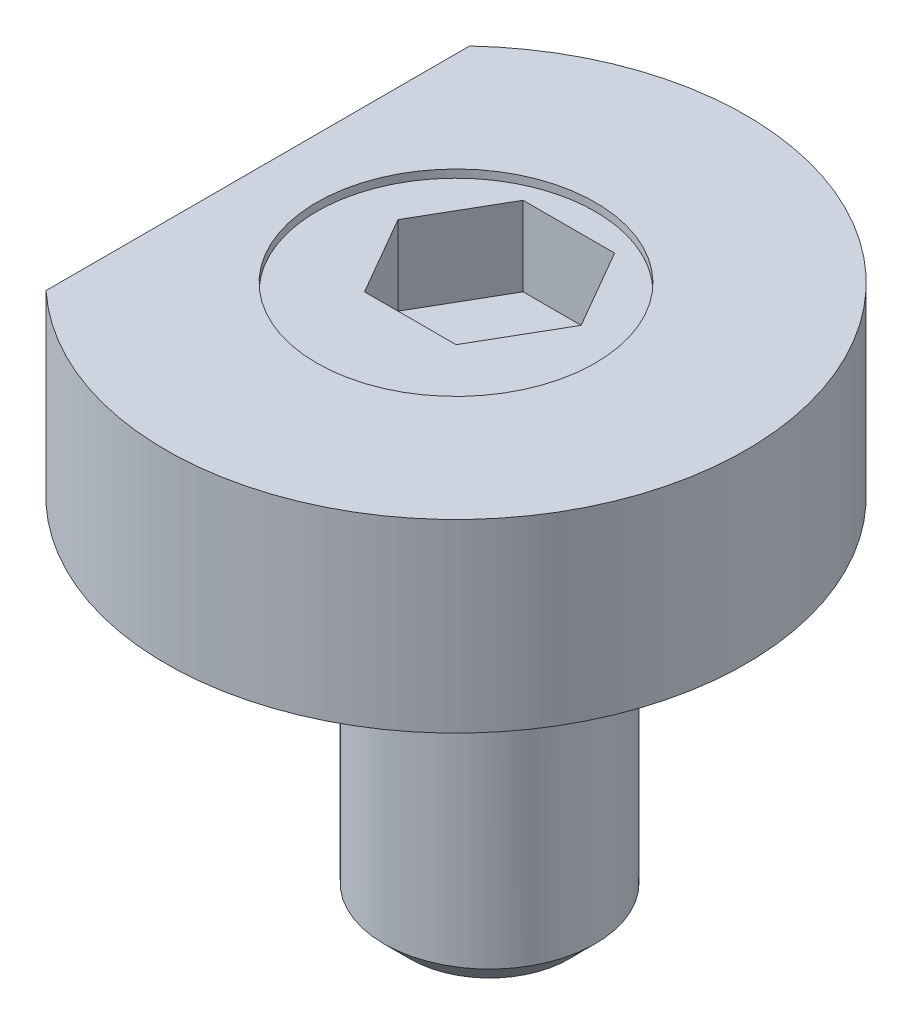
ISO-10303-21;
HEADER;
FILE_DESCRIPTION(('STEP AP214'),'2;1');
FILE_NAME('part.step','',(''),(''),'','','');
FILE_SCHEMA(('AUTOMOTIVE_DESIGN { 1 0 10303 214 1 1 1 1 }'));
ENDSEC;
DATA;
#1=APPLICATION_CONTEXT('core data for automotive mechanical design processes');
#2=APPLICATION_PROTOCOL_DEFINITION('international standard','automotive_design',2000,#1);
#3=PRODUCT_CONTEXT('',#1,'mechanical');
#4=PRODUCT('Part','Part','',(#3));
#5=PRODUCT_RELATED_PRODUCT_CATEGORY('part','',(#4));
#6=PRODUCT_DEFINITION_FORMATION('','',#4);
#7=PRODUCT_DEFINITION_CONTEXT('part definition',#1,'design');
#8=PRODUCT_DEFINITION('design','',#6,#7);
#9=PRODUCT_DEFINITION_SHAPE('','',#8);
#10=(LENGTH_UNIT() NAMED_UNIT(*) SI_UNIT(.MILLI.,.METRE.));
#11=(NAMED_UNIT(*) PLANE_ANGLE_UNIT() SI_UNIT($,.RADIAN.));
#12=(NAMED_UNIT(*) SI_UNIT($,.STERADIAN.) SOLID_ANGLE_UNIT());
#13=UNCERTAINTY_MEASURE_WITH_UNIT(LENGTH_MEASURE(1.E-05),#10,'distance_accuracy_value','');
#14=(GEOMETRIC_REPRESENTATION_CONTEXT(3) GLOBAL_UNCERTAINTY_ASSIGNED_CONTEXT((#13)) GLOBAL_UNIT_ASSIGNED_CONTEXT((#10,
#11,#12)) REPRESENTATION_CONTEXT('',''));
#15=CARTESIAN_POINT('',(0.,0.,0.));
#16=DIRECTION('',(0.,0.,1.));
#17=DIRECTION('',(1.,0.,0.));
#18=AXIS2_PLACEMENT_3D('',#15,#16,#17);
#19=CARTESIAN_POINT('',(0.,-28.6,-2.54));
#20=DIRECTION('',(0.,1.,0.));
#21=DIRECTION('',(0.,0.,1.));
#22=AXIS2_PLACEMENT_3D('',#19,#20,#21);
#23=CYLINDRICAL_SURFACE('',#22,8.);
#24=CARTESIAN_POINT('',(0.,-26.6,-2.54));
#25=DIRECTION('',(0.,1.,0.));
#26=DIRECTION('',(0.,0.,1.));
#27=AXIS2_PLACEMENT_3D('',#24,#25,#26);
#28=CIRCLE('',#27,8.);
#29=CARTESIAN_POINT('',(0.,-26.6,5.46));
#30=VERTEX_POINT('',#29);
#31=EDGE_CURVE('P0_E24',#30,#30,#28,.T.);
#32=ORIENTED_EDGE('',*,*,#31,.T.);
#33=EDGE_LOOP('',(#32));
#34=FACE_BOUND('',#33,.T.);
#35=CARTESIAN_POINT('',(0.,3.4,-2.54));
#36=DIRECTION('',(0.,1.,0.));
#37=DIRECTION('',(0.,0.,1.));
#38=AXIS2_PLACEMENT_3D('',#35,#36,#37);
#39=CIRCLE('',#38,8.);
#40=CARTESIAN_POINT('',(0.,3.4,-10.54));
#41=VERTEX_POINT('',#40);
#42=EDGE_CURVE('P0_E37',#41,#41,#39,.T.);
#43=ORIENTED_EDGE('',*,*,#42,.F.);
#44=EDGE_LOOP('',(#43));
#45=FACE_BOUND('',#44,.T.);
#46=ADVANCED_FACE('P0_F16',(#34,#45),#23,.T.);
#47=CARTESIAN_POINT('',(0.,-28.6,-2.54));
#48=DIRECTION('',(0.,1.,0.));
#49=DIRECTION('',(0.,0.,1.));
#50=AXIS2_PLACEMENT_3D('',#47,#48,#49);
#51=PLANE('',#50);
#52=CARTESIAN_POINT('',(0.,-28.6,-2.54));
#53=DIRECTION('',(0.,1.,0.));
#54=DIRECTION('',(0.,0.,1.));
#55=AXIS2_PLACEMENT_3D('',#52,#53,#54);
#56=CIRCLE('',#55,5.99999999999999);
#57=CARTESIAN_POINT('',(0.,-28.6,3.45999999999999));
#58=VERTEX_POINT('',#57);
#59=EDGE_CURVE('P0_E11',#58,#58,#56,.F.);
#60=ORIENTED_EDGE('',*,*,#59,.T.);
#61=EDGE_LOOP('',(#60));
#62=FACE_BOUND('',#61,.T.);
#63=ADVANCED_FACE('P0_F137',(#62),#51,.F.);
#64=CARTESIAN_POINT('',(0.,-26.6,-2.54));
#65=DIRECTION('',(0.,1.,0.));
#66=DIRECTION('',(0.,0.,1.));
#67=AXIS2_PLACEMENT_3D('',#64,#65,#66);
#68=CONICAL_SURFACE('',#67,8.,0.78539816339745);
#69=ORIENTED_EDGE('',*,*,#59,.F.);
#70=EDGE_LOOP('',(#69));
#71=FACE_BOUND('',#70,.T.);
#72=ORIENTED_EDGE('',*,*,#31,.F.);
#73=EDGE_LOOP('',(#72));
#74=FACE_BOUND('',#73,.T.);
#75=ADVANCED_FACE('P0_F18',(#71,#74),#68,.T.);
#76=CARTESIAN_POINT('',(0.,3.4,0.));
#77=DIRECTION('',(0.,1.,0.));
#78=DIRECTION('',(0.,0.,1.));
#79=AXIS2_PLACEMENT_3D('',#76,#77,#78);
#80=PLANE('',#79);
#81=CARTESIAN_POINT('',(0.,3.4,0.));
#82=DIRECTION('',(0.,1.,0.));
#83=DIRECTION('',(0.,0.,1.));
#84=AXIS2_PLACEMENT_3D('',#81,#82,#83);
#85=CIRCLE('',#84,10.54);
#86=EDGE_CURVE('P0_E118',#41,#41,#85,.T.);
#87=ORIENTED_EDGE('',*,*,#86,.F.);
#88=ORIENTED_EDGE('',*,*,#42,.T.);
#89=EDGE_LOOP('',(#87,#88));
#90=FACE_BOUND('',#89,.T.);
#91=ADVANCED_FACE('P0_F136',(#90),#80,.F.);
#92=CARTESIAN_POINT('',(0.,13.4,0.));
#93=DIRECTION('',(0.,-1.,0.));
#94=DIRECTION('',(0.,0.,-1.));
#95=AXIS2_PLACEMENT_3D('',#92,#93,#94);
#96=CYLINDRICAL_SURFACE('',#95,10.54);
#97=CARTESIAN_POINT('',(0.,13.4,0.));
#98=DIRECTION('',(0.,1.,0.));
#99=DIRECTION('',(0.,0.,1.));
#100=AXIS2_PLACEMENT_3D('',#97,#98,#99);
#101=CIRCLE('',#100,10.54);
#102=CARTESIAN_POINT('',(0.,13.4,10.54));
#103=VERTEX_POINT('',#102);
#104=EDGE_CURVE('P0_E126',#103,#103,#101,.T.);
#105=ORIENTED_EDGE('',*,*,#104,.F.);
#106=EDGE_LOOP('',(#105));
#107=FACE_BOUND('',#106,.T.);
#108=ORIENTED_EDGE('',*,*,#86,.T.);
#109=EDGE_LOOP('',(#108));
#110=FACE_BOUND('',#109,.T.);
#111=ADVANCED_FACE('P0_F144',(#107,#110),#96,.T.);
#112=CARTESIAN_POINT('',(0.,13.4,0.));
#113=DIRECTION('',(0.,1.,0.));
#114=DIRECTION('',(0.,0.,1.));
#115=AXIS2_PLACEMENT_3D('',#112,#113,#114);
#116=PLANE('',#115);
#117=DIRECTION('',(-0.5,0.,-0.866025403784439));
#118=VECTOR('',#117,1.);
#119=CARTESIAN_POINT('',(6.92820323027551,13.4,-2.54));
#120=LINE('',#119,#118);
#121=CARTESIAN_POINT('',(6.92820323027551,13.4,-2.54));
#122=VERTEX_POINT('',#121);
#123=CARTESIAN_POINT('',(3.46410161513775,13.4,-8.54));
#124=VERTEX_POINT('',#123);
#125=EDGE_CURVE('P0_E31',#122,#124,#120,.T.);
#126=ORIENTED_EDGE('',*,*,#125,.F.);
#127=DIRECTION('',(0.5,0.,-0.866025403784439));
#128=VECTOR('',#127,1.);
#129=CARTESIAN_POINT('',(3.46410161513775,13.4,3.46));
#130=LINE('',#129,#128);
#131=CARTESIAN_POINT('',(3.46410161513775,13.4,3.46));
#132=VERTEX_POINT('',#131);
#133=EDGE_CURVE('P0_E92',#132,#122,#130,.T.);
#134=ORIENTED_EDGE('',*,*,#133,.F.);
#135=DIRECTION('',(1.,0.,0.));
#136=VECTOR('',#135,1.);
#137=CARTESIAN_POINT('',(-3.46410161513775,13.4,3.46));
#138=LINE('',#137,#136);
#139=CARTESIAN_POINT('',(-3.46410161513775,13.4,3.46));
#140=VERTEX_POINT('',#139);
#141=EDGE_CURVE('P0_E95',#140,#132,#138,.T.);
#142=ORIENTED_EDGE('',*,*,#141,.F.);
#143=DIRECTION('',(0.5,0.,0.866025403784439));
#144=VECTOR('',#143,1.);
#145=CARTESIAN_POINT('',(-6.92820323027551,13.4,-2.54));
#146=LINE('',#145,#144);
#147=CARTESIAN_POINT('',(-6.92820323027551,13.4,-2.54));
#148=VERTEX_POINT('',#147);
#149=EDGE_CURVE('P0_E111',#148,#140,#146,.T.);
#150=ORIENTED_EDGE('',*,*,#149,.F.);
#151=DIRECTION('',(-0.5,0.,0.866025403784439));
#152=VECTOR('',#151,1.);
#153=CARTESIAN_POINT('',(-3.46410161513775,13.4,-8.54));
#154=LINE('',#153,#152);
#155=CARTESIAN_POINT('',(-3.46410161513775,13.4,-8.54));
#156=VERTEX_POINT('',#155);
#157=EDGE_CURVE('P0_E108',#156,#148,#154,.T.);
#158=ORIENTED_EDGE('',*,*,#157,.F.);
#159=DIRECTION('',(-1.,0.,0.));
#160=VECTOR('',#159,1.);
#161=CARTESIAN_POINT('',(3.46410161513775,13.4,-8.54));
#162=LINE('',#161,#160);
#163=EDGE_CURVE('P0_E106',#124,#156,#162,.T.);
#164=ORIENTED_EDGE('',*,*,#163,.F.);
#165=EDGE_LOOP('',(#126,#134,#142,#150,#158,#164));
#166=FACE_BOUND('',#165,.T.);
#167=ORIENTED_EDGE('',*,*,#104,.T.);
#168=EDGE_LOOP('',(#167));
#169=FACE_BOUND('',#168,.T.);
#170=ADVANCED_FACE('P0_F155',(#166,#169),#116,.T.);
#171=CARTESIAN_POINT('',(6.92820323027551,7.4,-2.54));
#172=DIRECTION('',(0.866025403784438,0.,-0.5));
#173=DIRECTION('',(-0.5,0.,-0.866025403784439));
#174=AXIS2_PLACEMENT_3D('',#171,#172,#173);
#175=PLANE('',#174);
#176=ORIENTED_EDGE('',*,*,#125,.T.);
#177=DIRECTION('',(0.,1.,0.));
#178=VECTOR('',#177,1.);
#179=CARTESIAN_POINT('',(3.46410161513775,7.4,-8.54));
#180=LINE('',#179,#178);
#181=CARTESIAN_POINT('',(3.46410161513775,7.4,-8.54));
#182=VERTEX_POINT('',#181);
#183=EDGE_CURVE('P0_E69',#182,#124,#180,.T.);
#184=ORIENTED_EDGE('',*,*,#183,.F.);
#185=DIRECTION('',(-0.5,0.,-0.866025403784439));
#186=VECTOR('',#185,1.);
#187=CARTESIAN_POINT('',(6.92820323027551,7.4,-2.54));
#188=LINE('',#187,#186);
#189=CARTESIAN_POINT('',(6.92820323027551,7.4,-2.54));
#190=VERTEX_POINT('',#189);
#191=EDGE_CURVE('P0_E73',#190,#182,#188,.T.);
#192=ORIENTED_EDGE('',*,*,#191,.F.);
#193=DIRECTION('',(0.,1.,0.));
#194=VECTOR('',#193,1.);
#195=CARTESIAN_POINT('',(6.92820323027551,7.4,-2.54));
#196=LINE('',#195,#194);
#197=EDGE_CURVE('P0_E116',#190,#122,#196,.T.);
#198=ORIENTED_EDGE('',*,*,#197,.T.);
#199=EDGE_LOOP('',(#176,#184,#192,#198));
#200=FACE_BOUND('',#199,.T.);
#201=ADVANCED_FACE('P0_F71',(#200),#175,.F.);
#202=CARTESIAN_POINT('',(3.46410161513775,7.4,3.46));
#203=DIRECTION('',(0.866025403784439,0.,0.5));
#204=DIRECTION('',(0.5,0.,-0.866025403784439));
#205=AXIS2_PLACEMENT_3D('',#202,#203,#204);
#206=PLANE('',#205);
#207=ORIENTED_EDGE('',*,*,#133,.T.);
#208=ORIENTED_EDGE('',*,*,#197,.F.);
#209=DIRECTION('',(0.5,0.,-0.866025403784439));
#210=VECTOR('',#209,1.);
#211=CARTESIAN_POINT('',(3.46410161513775,7.4,3.46));
#212=LINE('',#211,#210);
#213=CARTESIAN_POINT('',(3.46410161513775,7.4,3.46));
#214=VERTEX_POINT('',#213);
#215=EDGE_CURVE('P0_E79',#214,#190,#212,.T.);
#216=ORIENTED_EDGE('',*,*,#215,.F.);
#217=DIRECTION('',(0.,1.,0.));
#218=VECTOR('',#217,1.);
#219=CARTESIAN_POINT('',(3.46410161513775,7.4,3.46));
#220=LINE('',#219,#218);
#221=EDGE_CURVE('P0_E119',#214,#132,#220,.T.);
#222=ORIENTED_EDGE('',*,*,#221,.T.);
#223=EDGE_LOOP('',(#207,#208,#216,#222));
#224=FACE_BOUND('',#223,.T.);
#225=ADVANCED_FACE('P0_F163',(#224),#206,.F.);
#226=CARTESIAN_POINT('',(-3.46410161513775,7.4,3.46));
#227=DIRECTION('',(0.,0.,1.));
#228=DIRECTION('',(1.,0.,0.));
#229=AXIS2_PLACEMENT_3D('',#226,#227,#228);
#230=PLANE('',#229);
#231=ORIENTED_EDGE('',*,*,#141,.T.);
#232=ORIENTED_EDGE('',*,*,#221,.F.);
#233=DIRECTION('',(1.,0.,0.));
#234=VECTOR('',#233,1.);
#235=CARTESIAN_POINT('',(-3.46410161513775,7.4,3.46));
#236=LINE('',#235,#234);
#237=CARTESIAN_POINT('',(-3.46410161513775,7.4,3.46));
#238=VERTEX_POINT('',#237);
#239=EDGE_CURVE('P0_E102',#238,#214,#236,.T.);
#240=ORIENTED_EDGE('',*,*,#239,.F.);
#241=DIRECTION('',(0.,1.,0.));
#242=VECTOR('',#241,1.);
#243=CARTESIAN_POINT('',(-3.46410161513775,7.4,3.46));
#244=LINE('',#243,#242);
#245=EDGE_CURVE('P0_E121',#238,#140,#244,.T.);
#246=ORIENTED_EDGE('',*,*,#245,.T.);
#247=EDGE_LOOP('',(#231,#232,#240,#246));
#248=FACE_BOUND('',#247,.T.);
#249=ADVANCED_FACE('P0_F173',(#248),#230,.F.);
#250=CARTESIAN_POINT('',(-6.92820323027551,7.4,-2.54));
#251=DIRECTION('',(-0.866025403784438,0.,0.5));
#252=DIRECTION('',(0.5,0.,0.866025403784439));
#253=AXIS2_PLACEMENT_3D('',#250,#251,#252);
#254=PLANE('',#253);
#255=ORIENTED_EDGE('',*,*,#149,.T.);
#256=ORIENTED_EDGE('',*,*,#245,.F.);
#257=DIRECTION('',(0.5,0.,0.866025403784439));
#258=VECTOR('',#257,1.);
#259=CARTESIAN_POINT('',(-6.92820323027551,7.4,-2.54));
#260=LINE('',#259,#258);
#261=CARTESIAN_POINT('',(-6.92820323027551,7.4,-2.54));
#262=VERTEX_POINT('',#261);
#263=EDGE_CURVE('P0_E99',#262,#238,#260,.T.);
#264=ORIENTED_EDGE('',*,*,#263,.F.);
#265=DIRECTION('',(0.,1.,0.));
#266=VECTOR('',#265,1.);
#267=CARTESIAN_POINT('',(-6.92820323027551,7.4,-2.54));
#268=LINE('',#267,#266);
#269=EDGE_CURVE('P0_E123',#262,#148,#268,.T.);
#270=ORIENTED_EDGE('',*,*,#269,.T.);
#271=EDGE_LOOP('',(#255,#256,#264,#270));
#272=FACE_BOUND('',#271,.T.);
#273=ADVANCED_FACE('P0_F169',(#272),#254,.F.);
#274=CARTESIAN_POINT('',(-3.46410161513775,7.4,-8.54));
#275=DIRECTION('',(-0.866025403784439,0.,-0.5));
#276=DIRECTION('',(-0.5,0.,0.866025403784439));
#277=AXIS2_PLACEMENT_3D('',#274,#275,#276);
#278=PLANE('',#277);
#279=ORIENTED_EDGE('',*,*,#157,.T.);
#280=ORIENTED_EDGE('',*,*,#269,.F.);
#281=DIRECTION('',(-0.5,0.,0.866025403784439));
#282=VECTOR('',#281,1.);
#283=CARTESIAN_POINT('',(-3.46410161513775,7.4,-8.54));
#284=LINE('',#283,#282);
#285=CARTESIAN_POINT('',(-3.46410161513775,7.4,-8.54));
#286=VERTEX_POINT('',#285);
#287=EDGE_CURVE('P0_E87',#286,#262,#284,.T.);
#288=ORIENTED_EDGE('',*,*,#287,.F.);
#289=DIRECTION('',(0.,1.,0.));
#290=VECTOR('',#289,1.);
#291=CARTESIAN_POINT('',(-3.46410161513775,7.4,-8.54));
#292=LINE('',#291,#290);
#293=EDGE_CURVE('P0_E78',#286,#156,#292,.T.);
#294=ORIENTED_EDGE('',*,*,#293,.T.);
#295=EDGE_LOOP('',(#279,#280,#288,#294));
#296=FACE_BOUND('',#295,.T.);
#297=ADVANCED_FACE('P0_F166',(#296),#278,.F.);
#298=CARTESIAN_POINT('',(3.46410161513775,7.4,-8.54));
#299=DIRECTION('',(0.,0.,-1.));
#300=DIRECTION('',(-1.,0.,0.));
#301=AXIS2_PLACEMENT_3D('',#298,#299,#300);
#302=PLANE('',#301);
#303=ORIENTED_EDGE('',*,*,#163,.T.);
#304=ORIENTED_EDGE('',*,*,#293,.F.);
#305=DIRECTION('',(-1.,0.,0.));
#306=VECTOR('',#305,1.);
#307=CARTESIAN_POINT('',(3.46410161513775,7.4,-8.54));
#308=LINE('',#307,#306);
#309=EDGE_CURVE('P0_E82',#182,#286,#308,.T.);
#310=ORIENTED_EDGE('',*,*,#309,.F.);
#311=ORIENTED_EDGE('',*,*,#183,.T.);
#312=EDGE_LOOP('',(#303,#304,#310,#311));
#313=FACE_BOUND('',#312,.T.);
#314=ADVANCED_FACE('P0_F83',(#313),#302,.F.);
#315=CARTESIAN_POINT('',(3.46410161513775,7.4,-8.54));
#316=DIRECTION('',(0.,1.,0.));
#317=DIRECTION('',(0.,0.,1.));
#318=AXIS2_PLACEMENT_3D('',#315,#316,#317);
#319=PLANE('',#318);
#320=ORIENTED_EDGE('',*,*,#191,.T.);
#321=ORIENTED_EDGE('',*,*,#309,.T.);
#322=ORIENTED_EDGE('',*,*,#287,.T.);
#323=ORIENTED_EDGE('',*,*,#263,.T.);
#324=ORIENTED_EDGE('',*,*,#239,.T.);
#325=ORIENTED_EDGE('',*,*,#215,.T.);
#326=EDGE_LOOP('',(#320,#321,#322,#323,#324,#325));
#327=FACE_BOUND('',#326,.T.);
#328=ADVANCED_FACE('P0_F89',(#327),#319,.T.);
#329=CLOSED_SHELL('',(#46,#63,#75,#91,#111,#170,#201,#225,#249,#273,#297,#314,#328));
#330=MANIFOLD_SOLID_BREP('P0_B1',#329);
#331=CARTESIAN_POINT('',(0.,14.,-2.54));
#332=DIRECTION('',(0.,-1.,0.));
#333=DIRECTION('',(0.,0.,-1.));
#334=AXIS2_PLACEMENT_3D('',#331,#332,#333);
#335=CYLINDRICAL_SURFACE('',#334,8.);
#336=CARTESIAN_POINT('',(0.,0.,-2.54));
#337=DIRECTION('',(0.,1.,0.));
#338=DIRECTION('',(0.,0.,1.));
#339=AXIS2_PLACEMENT_3D('',#336,#337,#338);
#340=CIRCLE('',#339,8.);
#341=CARTESIAN_POINT('',(0.,0.,5.46));
#342=VERTEX_POINT('',#341);
#343=EDGE_CURVE('P1_E61',#342,#342,#340,.T.);
#344=ORIENTED_EDGE('',*,*,#343,.F.);
#345=EDGE_LOOP('',(#344));
#346=FACE_BOUND('',#345,.T.);
#347=CARTESIAN_POINT('',(0.,3.4,-2.54));
#348=DIRECTION('',(0.,1.,0.));
#349=DIRECTION('',(0.,0.,1.));
#350=AXIS2_PLACEMENT_3D('',#347,#348,#349);
#351=CIRCLE('',#350,8.);
#352=CARTESIAN_POINT('',(0.,3.4,-10.54));
#353=VERTEX_POINT('',#352);
#354=EDGE_CURVE('P1_E10',#353,#353,#351,.T.);
#355=ORIENTED_EDGE('',*,*,#354,.T.);
#356=EDGE_LOOP('',(#355));
#357=FACE_BOUND('',#356,.T.);
#358=ADVANCED_FACE('P1_F15',(#346,#357),#335,.F.);
#359=CARTESIAN_POINT('',(0.,14.,0.));
#360=DIRECTION('',(0.,1.,0.));
#361=DIRECTION('',(0.,0.,1.));
#362=AXIS2_PLACEMENT_3D('',#359,#360,#361);
#363=PLANE('',#362);
#364=CARTESIAN_POINT('',(0.,14.,0.));
#365=DIRECTION('',(0.,1.,0.));
#366=DIRECTION('',(0.,0.,1.));
#367=AXIS2_PLACEMENT_3D('',#364,#365,#366);
#368=CIRCLE('',#367,10.54);
#369=CARTESIAN_POINT('',(0.,14.,10.54));
#370=VERTEX_POINT('',#369);
#371=EDGE_CURVE('P1_E68',#370,#370,#368,.T.);
#372=ORIENTED_EDGE('',*,*,#371,.F.);
#373=EDGE_LOOP('',(#372));
#374=FACE_BOUND('',#373,.T.);
#375=CARTESIAN_POINT('',(0.,14.,0.));
#376=DIRECTION('',(0.,1.,0.));
#377=DIRECTION('',(0.,0.,1.));
#378=AXIS2_PLACEMENT_3D('',#375,#376,#377);
#379=CIRCLE('',#378,21.95);
#380=CARTESIAN_POINT('',(-15.,14.,16.0250585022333));
#381=VERTEX_POINT('',#380);
#382=CARTESIAN_POINT('',(-15.,14.,-16.0250585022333));
#383=VERTEX_POINT('',#382);
#384=EDGE_CURVE('P1_E54',#381,#383,#379,.T.);
#385=ORIENTED_EDGE('',*,*,#384,.T.);
#386=DIRECTION('',(0.,0.,1.));
#387=VECTOR('',#386,1.);
#388=CARTESIAN_POINT('',(-15.,14.,-16.0250585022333));
#389=LINE('',#388,#387);
#390=EDGE_CURVE('P1_E35',#383,#381,#389,.T.);
#391=ORIENTED_EDGE('',*,*,#390,.T.);
#392=EDGE_LOOP('',(#385,#391));
#393=FACE_BOUND('',#392,.T.);
#394=ADVANCED_FACE('P1_F76',(#374,#393),#363,.T.);
#395=CARTESIAN_POINT('',(0.,0.,0.));
#396=DIRECTION('',(0.,1.,0.));
#397=DIRECTION('',(0.,0.,1.));
#398=AXIS2_PLACEMENT_3D('',#395,#396,#397);
#399=PLANE('',#398);
#400=CARTESIAN_POINT('',(0.,0.,0.));
#401=DIRECTION('',(0.,1.,0.));
#402=DIRECTION('',(0.,0.,1.));
#403=AXIS2_PLACEMENT_3D('',#400,#401,#402);
#404=CIRCLE('',#403,21.95);
#405=CARTESIAN_POINT('',(-15.,0.,16.0250585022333));
#406=VERTEX_POINT('',#405);
#407=CARTESIAN_POINT('',(-15.,0.,-16.0250585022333));
#408=VERTEX_POINT('',#407);
#409=EDGE_CURVE('P1_E55',#406,#408,#404,.T.);
#410=ORIENTED_EDGE('',*,*,#409,.F.);
#411=DIRECTION('',(0.,0.,1.));
#412=VECTOR('',#411,1.);
#413=CARTESIAN_POINT('',(-15.,0.,-16.0250585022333));
#414=LINE('',#413,#412);
#415=EDGE_CURVE('P1_E45',#408,#406,#414,.T.);
#416=ORIENTED_EDGE('',*,*,#415,.F.);
#417=EDGE_LOOP('',(#410,#416));
#418=FACE_BOUND('',#417,.T.);
#419=ORIENTED_EDGE('',*,*,#343,.T.);
#420=EDGE_LOOP('',(#419));
#421=FACE_BOUND('',#420,.T.);
#422=ADVANCED_FACE('P1_F59',(#418,#421),#399,.F.);
#423=CARTESIAN_POINT('',(0.,14.,0.));
#424=DIRECTION('',(0.,-1.,0.));
#425=DIRECTION('',(0.,0.,-1.));
#426=AXIS2_PLACEMENT_3D('',#423,#424,#425);
#427=CYLINDRICAL_SURFACE('',#426,21.95);
#428=ORIENTED_EDGE('',*,*,#409,.T.);
#429=DIRECTION('',(0.,-1.,0.));
#430=VECTOR('',#429,1.);
#431=CARTESIAN_POINT('',(-15.,14.,-16.0250585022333));
#432=LINE('',#431,#430);
#433=EDGE_CURVE('P1_E23',#383,#408,#432,.T.);
#434=ORIENTED_EDGE('',*,*,#433,.F.);
#435=ORIENTED_EDGE('',*,*,#384,.F.);
#436=DIRECTION('',(0.,-1.,0.));
#437=VECTOR('',#436,1.);
#438=CARTESIAN_POINT('',(-15.,14.,16.0250585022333));
#439=LINE('',#438,#437);
#440=EDGE_CURVE('P1_E48',#381,#406,#439,.T.);
#441=ORIENTED_EDGE('',*,*,#440,.T.);
#442=EDGE_LOOP('',(#428,#434,#435,#441));
#443=FACE_BOUND('',#442,.T.);
#444=ADVANCED_FACE('P1_F17',(#443),#427,.T.);
#445=CARTESIAN_POINT('',(-15.,14.,-16.0250585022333));
#446=DIRECTION('',(1.,0.,0.));
#447=DIRECTION('',(0.,0.,-1.));
#448=AXIS2_PLACEMENT_3D('',#445,#446,#447);
#449=PLANE('',#448);
#450=ORIENTED_EDGE('',*,*,#415,.T.);
#451=ORIENTED_EDGE('',*,*,#440,.F.);
#452=ORIENTED_EDGE('',*,*,#390,.F.);
#453=ORIENTED_EDGE('',*,*,#433,.T.);
#454=EDGE_LOOP('',(#450,#451,#452,#453));
#455=FACE_BOUND('',#454,.T.);
#456=ADVANCED_FACE('P1_F47',(#455),#449,.F.);
#457=CARTESIAN_POINT('',(0.,3.4,0.));
#458=DIRECTION('',(0.,1.,0.));
#459=DIRECTION('',(0.,0.,1.));
#460=AXIS2_PLACEMENT_3D('',#457,#458,#459);
#461=CYLINDRICAL_SURFACE('',#460,10.54);
#462=ORIENTED_EDGE('',*,*,#371,.T.);
#463=EDGE_LOOP('',(#462));
#464=FACE_BOUND('',#463,.T.);
#465=CARTESIAN_POINT('',(0.,3.4,0.));
#466=DIRECTION('',(0.,1.,0.));
#467=DIRECTION('',(0.,0.,1.));
#468=AXIS2_PLACEMENT_3D('',#465,#466,#467);
#469=CIRCLE('',#468,10.54);
#470=EDGE_CURVE('P1_E28',#353,#353,#469,.T.);
#471=ORIENTED_EDGE('',*,*,#470,.F.);
#472=EDGE_LOOP('',(#471));
#473=FACE_BOUND('',#472,.T.);
#474=ADVANCED_FACE('P1_F87',(#464,#473),#461,.F.);
#475=CARTESIAN_POINT('',(0.,3.4,0.));
#476=DIRECTION('',(0.,1.,0.));
#477=DIRECTION('',(0.,0.,1.));
#478=AXIS2_PLACEMENT_3D('',#475,#476,#477);
#479=PLANE('',#478);
#480=ORIENTED_EDGE('',*,*,#470,.T.);
#481=ORIENTED_EDGE('',*,*,#354,.F.);
#482=EDGE_LOOP('',(#480,#481));
#483=FACE_BOUND('',#482,.T.);
#484=ADVANCED_FACE('P1_F73',(#483),#479,.T.);
#485=CLOSED_SHELL('',(#358,#394,#422,#444,#456,#474,#484));
#486=MANIFOLD_SOLID_BREP('P1_B1',#485);
#487=ADVANCED_BREP_SHAPE_REPRESENTATION('',(#18,#330,#486),#14);
#488=SHAPE_DEFINITION_REPRESENTATION(#9,#487);
ENDSEC;
END-ISO-10303-21;
